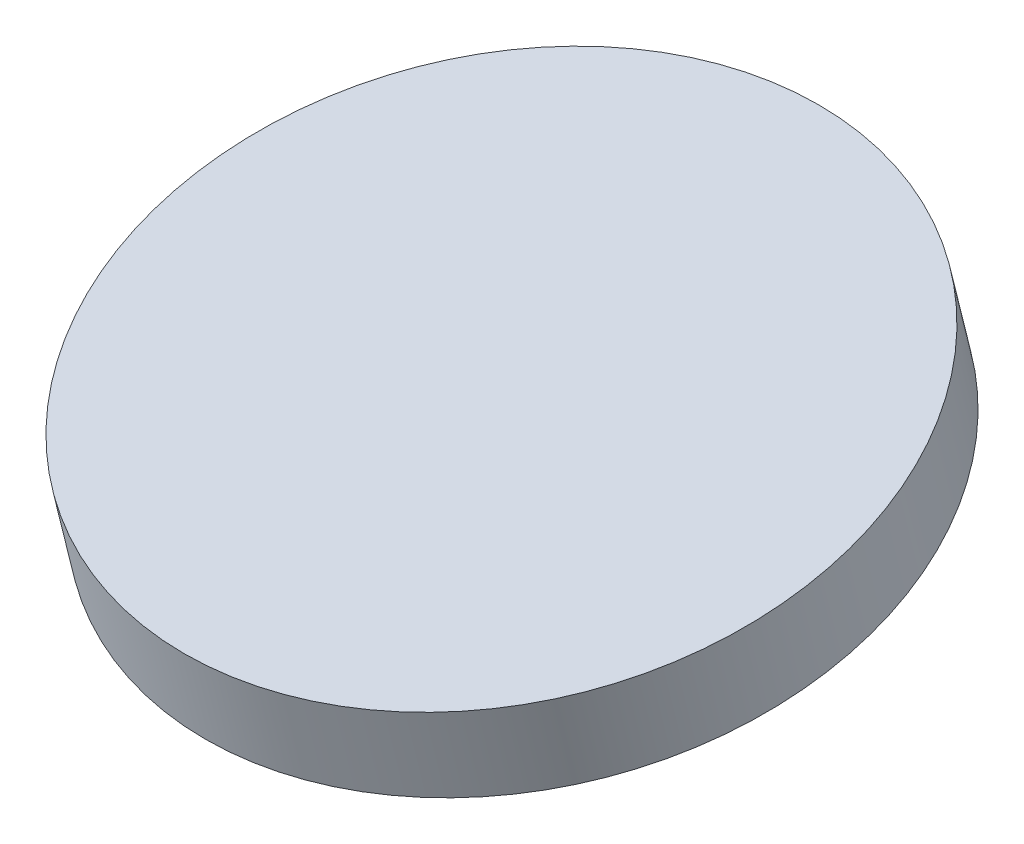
ISO-10303-21;
HEADER;
FILE_DESCRIPTION(('STEP AP214'),'2;1');
FILE_NAME('part.step','',(''),(''),'','','');
FILE_SCHEMA(('AUTOMOTIVE_DESIGN { 1 0 10303 214 1 1 1 1 }'));
ENDSEC;
DATA;
#1=APPLICATION_CONTEXT('core data for automotive mechanical design processes');
#2=APPLICATION_PROTOCOL_DEFINITION('international standard','automotive_design',2000,#1);
#3=PRODUCT_CONTEXT('',#1,'mechanical');
#4=PRODUCT('Part','Part','',(#3));
#5=PRODUCT_RELATED_PRODUCT_CATEGORY('part','',(#4));
#6=PRODUCT_DEFINITION_FORMATION('','',#4);
#7=PRODUCT_DEFINITION_CONTEXT('part definition',#1,'design');
#8=PRODUCT_DEFINITION('design','',#6,#7);
#9=PRODUCT_DEFINITION_SHAPE('','',#8);
#10=(LENGTH_UNIT() NAMED_UNIT(*) SI_UNIT(.MILLI.,.METRE.));
#11=(NAMED_UNIT(*) PLANE_ANGLE_UNIT() SI_UNIT($,.RADIAN.));
#12=(NAMED_UNIT(*) SI_UNIT($,.STERADIAN.) SOLID_ANGLE_UNIT());
#13=UNCERTAINTY_MEASURE_WITH_UNIT(LENGTH_MEASURE(1.E-05),#10,'distance_accuracy_value','');
#14=(GEOMETRIC_REPRESENTATION_CONTEXT(3) GLOBAL_UNCERTAINTY_ASSIGNED_CONTEXT((#13)) GLOBAL_UNIT_ASSIGNED_CONTEXT((#10,
#11,#12)) REPRESENTATION_CONTEXT('',''));
#15=CARTESIAN_POINT('',(0.,0.,0.));
#16=DIRECTION('',(0.,0.,1.));
#17=DIRECTION('',(1.,0.,0.));
#18=AXIS2_PLACEMENT_3D('',#15,#16,#17);
#19=CARTESIAN_POINT('',(-745.722223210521,-215.029692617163,-497.92500145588));
#20=DIRECTION('',(0.,0.970295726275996,0.241921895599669));
#21=DIRECTION('',(0.,-0.241921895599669,0.970295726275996));
#22=AXIS2_PLACEMENT_3D('',#19,#20,#21);
#23=PLANE('',#22);
#24=CARTESIAN_POINT('',(-745.722223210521,-215.018715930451,-497.969026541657));
#25=DIRECTION('',(0.,0.970295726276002,0.241921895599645));
#26=DIRECTION('',(0.,-0.241921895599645,0.970295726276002));
#27=AXIS2_PLACEMENT_3D('',#24,#25,#26);
#28=CIRCLE('',#27,4.76250000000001);
#29=CARTESIAN_POINT('',(-745.722223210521,-216.170868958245,-493.347993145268));
#30=VERTEX_POINT('',#29);
#31=EDGE_CURVE('E18',#30,#30,#28,.T.);
#32=ORIENTED_EDGE('',*,*,#31,.F.);
#33=EDGE_LOOP('',(#32));
#34=FACE_BOUND('',#33,.T.);
#35=ADVANCED_FACE('F15',(#34),#23,.F.);
#36=CARTESIAN_POINT('',(-745.722223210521,-215.018715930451,-497.969026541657));
#37=DIRECTION('',(0.,0.970295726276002,0.241921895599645));
#38=DIRECTION('',(0.,-0.241921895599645,0.970295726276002));
#39=AXIS2_PLACEMENT_3D('',#36,#37,#38);
#40=CYLINDRICAL_SURFACE('',#39,4.76250000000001);
#41=CARTESIAN_POINT('',(-745.722223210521,-213.786440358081,-497.661785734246));
#42=DIRECTION('',(0.,0.970295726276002,0.241921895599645));
#43=DIRECTION('',(0.,-0.241921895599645,0.970295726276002));
#44=AXIS2_PLACEMENT_3D('',#41,#42,#43);
#45=CIRCLE('',#44,4.76250000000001);
#46=CARTESIAN_POINT('',(-745.722223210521,-214.938593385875,-493.040752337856));
#47=VERTEX_POINT('',#46);
#48=EDGE_CURVE('E10',#47,#47,#45,.T.);
#49=ORIENTED_EDGE('',*,*,#48,.F.);
#50=EDGE_LOOP('',(#49));
#51=FACE_BOUND('',#50,.T.);
#52=ORIENTED_EDGE('',*,*,#31,.T.);
#53=EDGE_LOOP('',(#52));
#54=FACE_BOUND('',#53,.T.);
#55=ADVANCED_FACE('F27',(#51,#54),#40,.T.);
#56=CARTESIAN_POINT('',(-745.722223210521,-213.786440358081,-497.661785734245));
#57=DIRECTION('',(0.,0.970295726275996,0.241921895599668));
#58=DIRECTION('',(0.,-0.241921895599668,0.970295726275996));
#59=AXIS2_PLACEMENT_3D('',#56,#57,#58);
#60=PLANE('',#59);
#61=ORIENTED_EDGE('',*,*,#48,.T.);
#62=EDGE_LOOP('',(#61));
#63=FACE_BOUND('',#62,.T.);
#64=ADVANCED_FACE('F34',(#63),#60,.T.);
#65=CLOSED_SHELL('',(#35,#55,#64));
#66=MANIFOLD_SOLID_BREP('B1',#65);
#67=ADVANCED_BREP_SHAPE_REPRESENTATION('',(#18,#66),#14);
#68=SHAPE_DEFINITION_REPRESENTATION(#9,#67);
ENDSEC;
END-ISO-10303-21;
